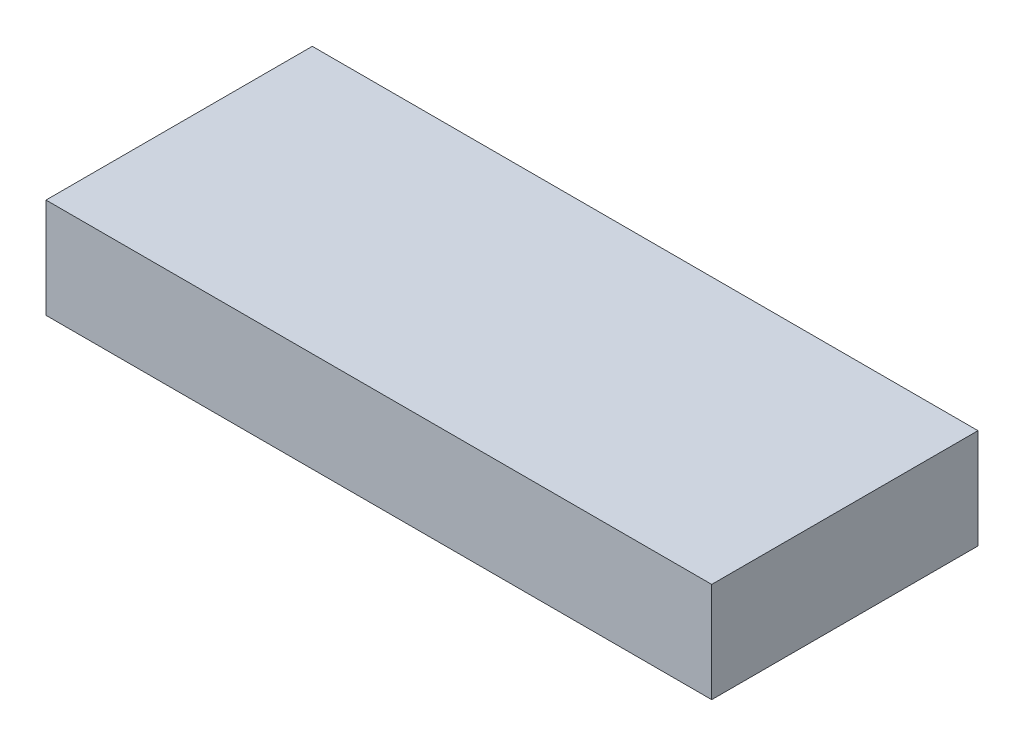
from build123d import *

# Parameters (mm, degrees)
SKETCH1_W      = 254
SKETCH1_H      = 101.6
EXTRUDE1_DEPTH = 38.1


with BuildPart() as part:
    # Sketch1 → Extrude1 (new body)
    with BuildSketch(Plane(origin=(0, 0, 0), x_dir=(1, 0, 0), z_dir=(0, 1, 0))):
        with Locations((127, 50.8)):
            Rectangle(SKETCH1_W, SKETCH1_H)
    extrude(amount=EXTRUDE1_DEPTH)

    # Cut-Sweep1: sweep along a path in Sketch2
    with BuildLine(Plane.XZ) as cut_sweep1_path:
        Line((0, -76.2), (63.5, -76.2))
        ThreePointArc((63.5, -76.2), (81.460512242, -68.760512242), (88.9, -50.8))
        ThreePointArc((88.9, -50.8), (120.65, -19.05), (152.4, -50.8))
        ThreePointArc((152.4, -50.8), (157.82951953, -70.402288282), (172.570588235, -84.417647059))
        Line((172.570588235, -84.417647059), (228.6, -114.3))
    # Sketch3 → Cut-Sweep1 (sweep, cut)
    with BuildSketch(Plane.ZY):
        Polygon((-82.55, 0), (-82.55, 6.35), (-88.9, 6.35), (-88.9, 12.7), (-82.55, 12.7), (-82.55, 25.4), (-69.85, 25.4), (-69.85, 12.7), (-63.5, 12.7), (-63.5, 6.35), (-69.85, 6.35), (-69.85, 0), align=None)
    sweep(path=cut_sweep1_path.line, mode=Mode.SUBTRACT)


solid = part.part
